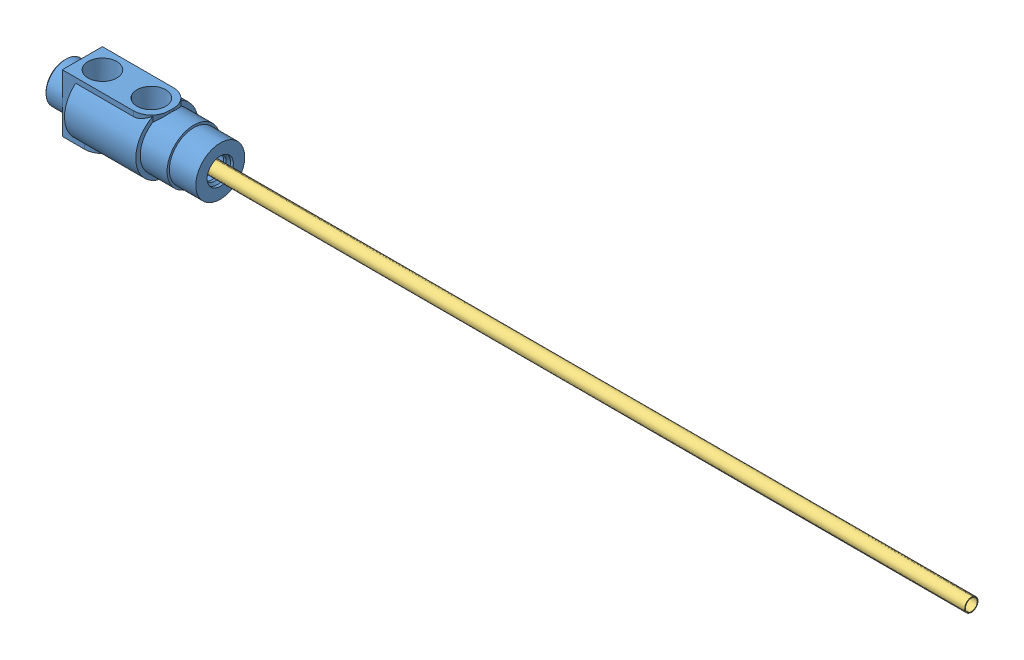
SolidWorks assembly RLQC1814.sldasm, configuration Default (file format 13000). Lengths in mm.
Overall size (323.53 21.43 22.23).
4 component instances, 3 part files, 4 mates.
Components (placement in the parent):
- RLQCH1814-1: RLQCH1814.SLDPRT [Default] at origin size (55.56 21.43 22.23)
- BR12-1: BR12.sldprt [Default] at (-55.5625 0 0) x (0 0.926689 0.375829) z (0 -0.375829 0.926689) size (10.25 6.35 10.25)
- BR12-2: BR12.sldprt [Default] at (-42.037 -10.3124 0) x (0.965387 0 -0.260823) z (-0.260823 0 -0.965387) size (10.25 6.35 10.25)
- PT06-187L12-1: PT06-187L12.SLDPRT [PT06-187L12] at (-36.83 0 0) x (0 0.058607 -0.998281) z (0 -0.998281 -0.058607) size (7.76 304.8 7.76)
Mates (geometry in assembly coordinates):
- ProfileCenter2: profile center: plane of RLQCH1814-1 through (-55.5625 0 0) normal (-1 0 0); circle of BR12-1
- ProfileCenter3: profile center: plane of BR12-2 through (-42.037 -10.3124 0) normal (0 -1 0); circle of RLQCH1814-1
- Distance1: distance = 36.83 mm: plane of RLQCH1814-1 through (0 -0.6494 0) normal (1 0 0); plane of PT06-187L12-1 through (-36.83 0 0) normal (-1 0 0)
- Concentric1: concentric aligned: cylinder of RLQCH1814-1 through (-4.7244 0 0) axis (1 0 0) radius 8.7312; cylinder of PT06-187L12-1 through (-36.83 0 0) axis (1 0 0) radius 2.3749
